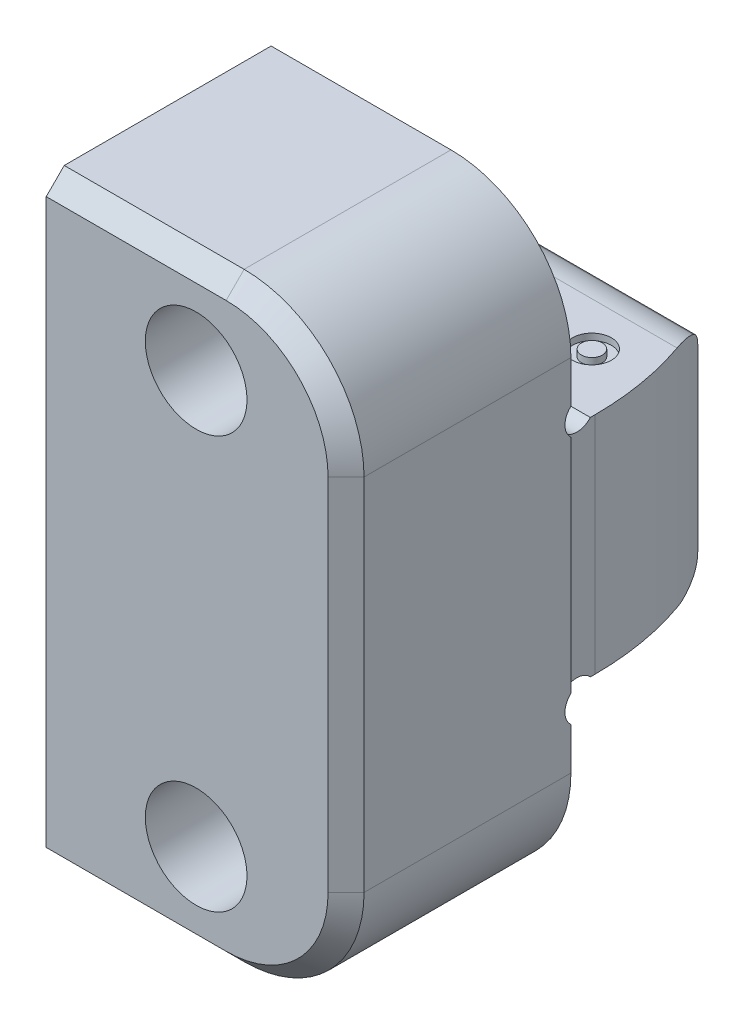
from build123d import *

# Parameters (mm, degrees)
BOSS_EXTRUDE2_DEPTH                            = 6.35
CBORE_FOR_6_SOCKET_HEAD_CAP_SCREW1_D           = 4.3053
CBORE_FOR_6_SOCKET_HEAD_CAP_SCREW1_CBORE_D     = 6.35
CBORE_FOR_6_SOCKET_HEAD_CAP_SCREW1_CBORE_DEPTH = 4.2672
FILLET1_R                                      = 5.08
CHAMFER1_SIZE                                  = 0.762
CUT_EXTRUDE1_DEPTH                             = 21.329919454
CUT_EXTRUDE3_DEPTH                             = 21.878178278
SKETCH6_R                                      = 0.762
CUT_EXTRUDE2_DEPTH                             = 21.329919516
SKETCH9_R                                      = 0.8255
SKETCH9_R_2                                    = 0.4445
CUT_EXTRUDE5_DEPTH                             = 0.2794


with BuildPart() as part:
    # Sketch2 → Boss-Extrude2 (new, symmetric)
    with BuildSketch(Plane(origin=(0, 0, 0), x_dir=(0, 0, -1), z_dir=(1, 0, 0))):
        Polygon((0, 4.75996), (0, 12.7), (-9.525, 12.7), (-9.525, -12.7), (0, -12.7), (0, -4.75996), (6.985, -4.75996), (6.985, 4.75996), align=None)
    extrude(amount=BOSS_EXTRUDE2_DEPTH, both=True)

    # CBORE for _6 Socket Head Cap Screw1 (through all)
    with Locations(Plane(origin=(0, 0, 0), x_dir=(-1, 0, 0), z_dir=(0, 0, -1))):
        with Locations((0, 8.73125), (0, -8.73125)):
            CounterBoreHole(CBORE_FOR_6_SOCKET_HEAD_CAP_SCREW1_D / 2, CBORE_FOR_6_SOCKET_HEAD_CAP_SCREW1_CBORE_D / 2, CBORE_FOR_6_SOCKET_HEAD_CAP_SCREW1_CBORE_DEPTH)

    # Fillet1
    fillet1_edges = [part.edges().sort_by_distance(p)[0] for p in [
        (6.35, -12.7, 4.7625),
        (6.35, 12.7, 4.7625),
    ]]
    fillet(fillet1_edges, radius=FILLET1_R)

    # Chamfer1
    chamfer1_edges = [part.edges().sort_by_distance(p)[0] for p in [
        (6.35, 0, 9.525),
        (-2.54, -12.7, 9.525),
        (-2.54, 12.7, 9.525),
        (4.862102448, 11.212102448, 9.525),
        (4.862102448, -11.212102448, 9.525),
    ]]
    chamfer(chamfer1_edges, length=CHAMFER1_SIZE)

    # Sketch5 → Cut-Extrude1 (cut, through all)
    with BuildSketch(Plane(origin=(6.35, 0, 0), x_dir=(0, 0, -1), z_dir=(1, 0, 0))):
        with BuildLine():
            Line((6.985, 4.75996), (5.461, 4.75996))
            ThreePointArc((5.461, 4.75996), (6.052660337, 4.682066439), (6.604, 4.453694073))
            ThreePointArc((6.604, 4.453694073), (6.882911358, 4.174782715), (6.985, 3.793782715))
            Line((6.985, 3.793782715), (6.985, 4.75996))
        make_face()
        with BuildLine():
            Line((6.985, -3.793782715), (6.985, -4.75996))
            Line((6.985, -4.75996), (5.461, -4.75996))
            ThreePointArc((5.461, -4.75996), (6.052660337, -4.682066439), (6.604, -4.453694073))
            ThreePointArc((6.604, -4.453694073), (6.882911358, -4.174782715), (6.985, -3.793782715))
        make_face()
    extrude(amount=-CUT_EXTRUDE1_DEPTH, mode=Mode.SUBTRACT)

    # Sketch7 → Cut-Extrude3 (cut, through all)
    with BuildSketch(Plane(origin=(0, 4.75996, 0), x_dir=(1, 0, 0), z_dir=(0, 1, 0))):
        with BuildLine():
            Line((4.737462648, 6.985), (6.35, 6.985))
            Line((6.35, 6.985), (6.35, 0))
            Line((6.35, 0), (6.096, 0))
            Line((6.096, 0), (6.096, 1.27))
            ThreePointArc((6.096, 1.27), (5.751698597, 4.207126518), (4.737462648, 6.985))
        make_face()
    extrude(amount=-CUT_EXTRUDE3_DEPTH, mode=Mode.SUBTRACT)

    # Sketch6 → Cut-Extrude2 (cut, through all)
    with BuildSketch(Plane(origin=(6.35, 0, 0), x_dir=(0, 0, -1), z_dir=(1, 0, 0))):
        with Locations((0.508, 5.26796)):
            Circle(SKETCH6_R)
        with Locations((0.508, -5.26796)):
            Circle(SKETCH6_R)
    extrude(amount=-CUT_EXTRUDE2_DEPTH, mode=Mode.SUBTRACT)

    # Sketch9 → Cut-Extrude5 (cut)
    # profile 1 of 4: a face of its own
    with BuildSketch(Plane(origin=(0, 4.75996, 0), x_dir=(1, 0, 0), z_dir=(0, 1, 0))):
        with Locations(Location((-4.0005, 3.6195, 0), (0, 0, 270))):
            Circle(SKETCH9_R)
        with Locations(Location((-4.0005, 3.6195, 0), (0, 0, 270))):
            Circle(SKETCH9_R_2, mode=Mode.SUBTRACT)
    # profile 2 of 4: a face of its own
    with BuildSketch(Plane(origin=(0, 4.75996, 0), x_dir=(1, 0, 0), z_dir=(0, 1, 0))):
        with Locations(Location((-1.4605, 3.6195, 0), (0, 0, 270))):
            Circle(SKETCH9_R)
        with Locations(Location((-1.4605, 3.6195, 0), (0, 0, 270))):
            Circle(SKETCH9_R_2, mode=Mode.SUBTRACT)
    # profile 3 of 4: a face of its own
    with BuildSketch(Plane(origin=(0, 4.75996, 0), x_dir=(1, 0, 0), z_dir=(0, 1, 0))):
        with Locations(Location((1.0795, 3.6195, 0), (0, 0, 270))):
            Circle(SKETCH9_R)
        with Locations(Location((1.0795, 3.6195, 0), (0, 0, 270))):
            Circle(SKETCH9_R_2, mode=Mode.SUBTRACT)
    # profile 4 of 4: a face of its own
    with BuildSketch(Plane(origin=(0, 4.75996, 0), x_dir=(1, 0, 0), z_dir=(0, 1, 0))):
        with Locations(Location((3.6195, 3.6195, 0), (0, 0, 270))):
            Circle(SKETCH9_R)
        with Locations(Location((3.6195, 3.6195, 0), (0, 0, 270))):
            Circle(SKETCH9_R_2, mode=Mode.SUBTRACT)
    cut_extrude5 = extrude(amount=-CUT_EXTRUDE5_DEPTH, mode=Mode.SUBTRACT)

    # Mirror2: Cut-Extrude5 across plane
    add(cut_extrude5.mirror(Plane.ZX), mode=Mode.SUBTRACT)


solid = part.part
